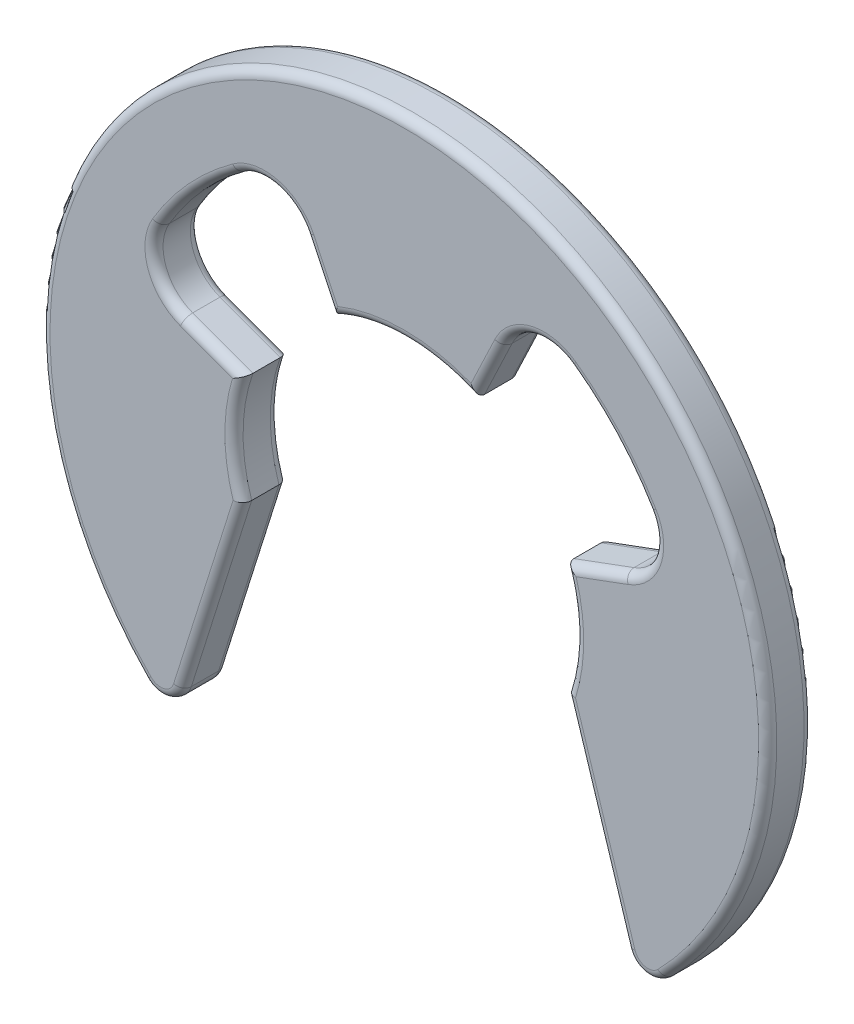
from build123d import *

# Parameters (mm, degrees)
EXTRUSION1_DEPTH = 1
CONG_1_R         = 0.2


with BuildPart() as part:
    # Esquisse1 → Extrusion1 (new body)
    with BuildSketch(Plane.XY):
        with BuildLine():
            Line((1.567339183, 3.406750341), (2.17332983, 4.682952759))
            ThreePointArc((2.17332983, 4.682952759), (2.828616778, 5.222762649), (3.662694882, 5.064303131))
            ThreePointArc((3.662694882, 5.064303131), (4.611336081, 4.218777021), (5.369345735, 3.198847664))
            ThreePointArc((5.369345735, 3.198847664), (5.45316543, 2.353998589), (4.857336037, 1.749198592))
            Line((4.857336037, 1.749198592), (3.532393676, 1.258846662))
            ThreePointArc((3.532393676, 1.258846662), (3.749766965, 0.041805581), (3.559581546, -1.17977931))
            Line((3.559581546, -1.17977931), (4.887496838, -5.391867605))
            ThreePointArc((4.887496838, -5.391867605), (5.24832354, -5.727879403), (5.721984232, -5.59096561))
            ThreePointArc((5.721984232, -5.59096561), (0, 8), (-5.721984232, -5.59096561))
            ThreePointArc((-5.721984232, -5.59096561), (-5.24832354, -5.727879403), (-4.887496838, -5.391867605))
            Line((-4.887496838, -5.391867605), (-3.559581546, -1.17977931))
            ThreePointArc((-3.559581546, -1.17977931), (-3.749766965, 0.041805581), (-3.532393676, 1.258846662))
            Line((-3.532393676, 1.258846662), (-4.857336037, 1.749198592))
            ThreePointArc((-4.857336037, 1.749198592), (-5.45316543, 2.353998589), (-5.369345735, 3.198847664))
            ThreePointArc((-5.369345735, 3.198847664), (-4.611336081, 4.218777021), (-3.662694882, 5.064303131))
            ThreePointArc((-3.662694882, 5.064303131), (-2.828616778, 5.222762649), (-2.17332983, 4.682952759))
            Line((-2.17332983, 4.682952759), (-1.567339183, 3.406750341))
            ThreePointArc((-1.567339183, 3.406750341), (0, 3.75), (1.567339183, 3.406750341))
        make_face()
    extrude(amount=EXTRUSION1_DEPTH)

    # Cong_1
    cong_1_edges = [part.edges().sort_by_distance(p)[0] for p in [
        (-2.828616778, 5.222762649, 0),
        (-2.828616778, 5.222762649, 1),
        (-1.870334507, 4.04485155, 0),
        (-1.870334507, 4.04485155, 1),
        (0, 3.75, 0),
        (0, 3.75, 1),
        (1.870334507, 4.04485155, 0),
        (1.870334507, 4.04485155, 1),
        (2.828616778, 5.222762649, 0),
        (2.828616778, 5.222762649, 1),
        (4.611336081, 4.218777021, 0),
        (4.611336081, 4.218777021, 1),
        (5.45316543, 2.353998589, 0),
        (5.45316543, 2.353998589, 1),
        (4.194864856, 1.504022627, 0),
        (4.194864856, 1.504022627, 1),
        (3.749766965, 0.041805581, 0),
        (3.749766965, 0.041805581, 1),
        (4.223539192, -3.285823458, 0),
        (4.223539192, -3.285823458, 1),
        (5.24832354, -5.727879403, 0),
        (5.24832354, -5.727879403, 1),
        (0, 8, 0),
        (0, 8, 1),
        (-5.24832354, -5.727879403, 0),
        (-5.24832354, -5.727879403, 1),
        (-4.223539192, -3.285823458, 0),
        (-4.223539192, -3.285823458, 1),
        (-3.749766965, 0.041805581, 0),
        (-3.749766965, 0.041805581, 1),
        (-4.194864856, 1.504022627, 0),
        (-4.194864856, 1.504022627, 1),
        (-5.45316543, 2.353998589, 0),
        (-5.45316543, 2.353998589, 1),
        (-4.611336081, 4.218777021, 0),
        (-4.611336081, 4.218777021, 1),
    ]]
    fillet(cong_1_edges, radius=CONG_1_R)


solid = part.part
